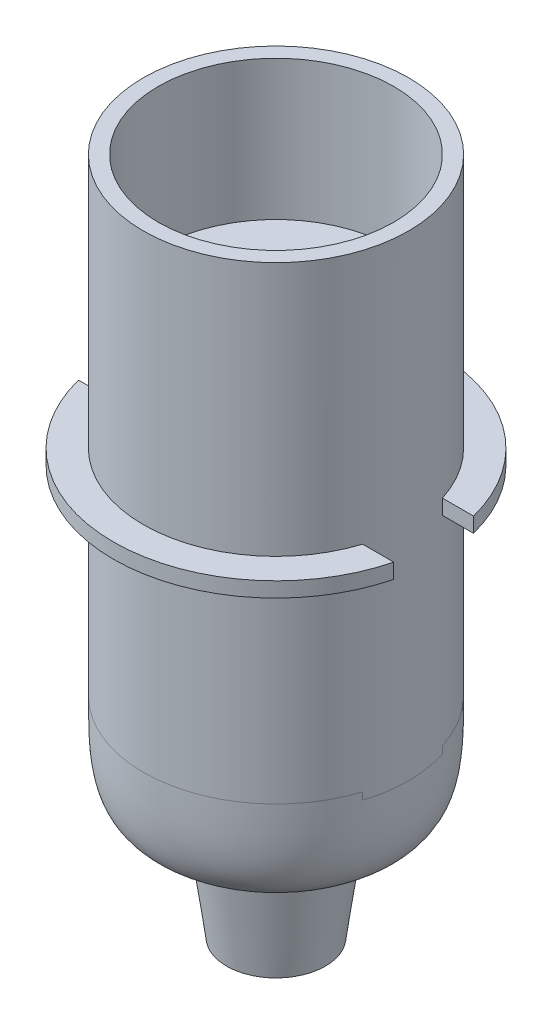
from build123d import *
from build123d.topology import SkipClean

# Parameters (mm, degrees)
ESQUISSE2_R             = 6.5
EXTRUSION1_DEPTH        = 11
EXTRUSION1_TAPER        = 8
ENL_V_MAT_EXTRU_1_DEPTH = 35


with BuildPart() as part:
    # Esquisse1 → R_volution1 (revolve)
    with BuildSketch(Plane.XY, mode=Mode.PRIVATE) as r_volution1_sk:
        with BuildLine():
            Line((8.15, 0), (0, 0))
            Line((0, 0), (0, 30))
            Line((0, 30), (6.6, 30))
            Line((6.6, 30), (6.6, 43))
            Line((6.6, 43), (11.8, 43))
            Line((11.8, 43), (11.8, 57))
            Line((11.8, 57), (13.3, 57))
            Line((13.3, 57), (13.3, 31.5))
            Line((13.3, 31.5), (16.3, 31.5))
            Line((16.3, 31.5), (16.3, 30))
            Line((16.3, 30), (13.3, 30))
            Line((13.3, 30), (13.3, 10))
            add(Edge.make_bspline(
                [(13.3, 10), (13.307154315, 4.130080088), (13.211608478, 0.024138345), (8.15, 0)],
                knots=[0, 0, 0, 0, 1, 1, 1, 1], degree=3))
        make_face()
    revolve(r_volution1_sk.sketch.rotate(Axis((0, 68.846267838, 0), (0, -1, 0)), 90), axis=Axis((0, 68.846267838, 0), (0, -1, 0)))

    # Esquisse2 → Extrusion1 (add)
    with BuildSketch(Plane.XZ):
        Circle(ESQUISSE2_R)
    extrude(amount=EXTRUSION1_DEPTH, taper=EXTRUSION1_TAPER)

    # Esquisse3 → Enl_v. mat.-Extru.1 (cut)
    with SkipClean():  # the faces are left unmerged after this step: merging them gives an invalid solid
        with BuildSketch(Plane(origin=(0, 0, 0), x_dir=(1, 0, 0), z_dir=(0, 1, 0))):
            with BuildLine():
                Line((12.684242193, -4), (16.438621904, -4))
                ThreePointArc((16.438621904, -4), (16.918282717, 0), (16.438621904, 4))
                Line((16.438621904, 4), (12.684242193, 4))
                ThreePointArc((12.684242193, 4), (13.3, 0), (12.684242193, -4))
            make_face()
            with BuildLine():
                Line((-12.684242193, 4), (-16.438621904, 4))
                ThreePointArc((-16.438621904, 4), (-16.918282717, 0), (-16.438621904, -4))
                Line((-16.438621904, -4), (-12.684242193, -4))
                ThreePointArc((-12.684242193, -4), (-13.3, 0), (-12.684242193, 4))
            make_face()
        extrude(amount=ENL_V_MAT_EXTRU_1_DEPTH, mode=Mode.SUBTRACT)


solid = part.part
